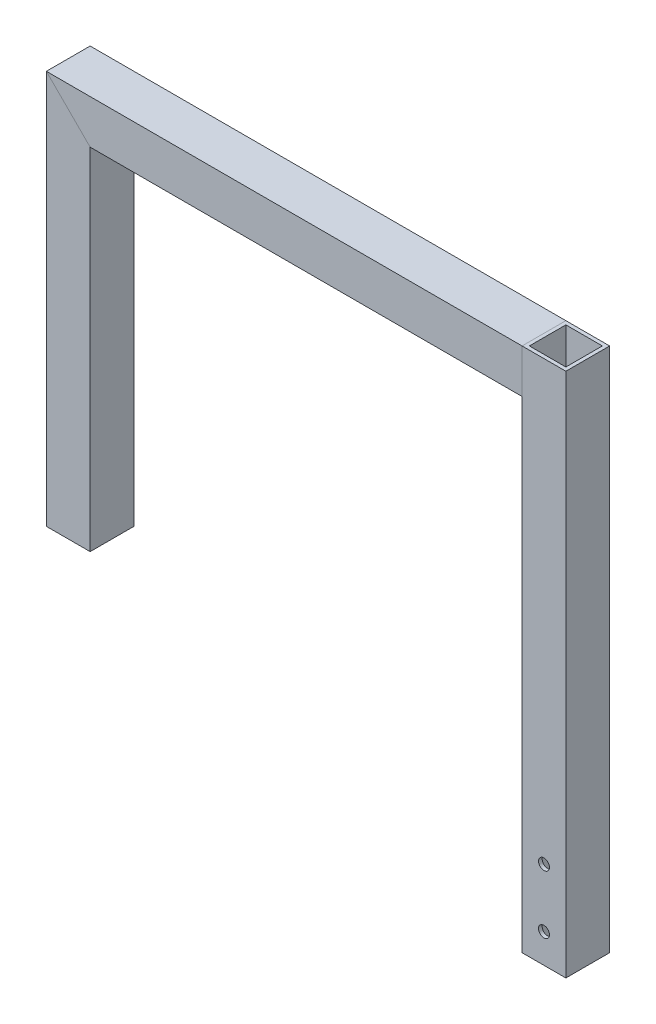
ISO-10303-21;
HEADER;
FILE_DESCRIPTION(('STEP AP214'),'2;1');
FILE_NAME('part.step','',(''),(''),'','','');
FILE_SCHEMA(('AUTOMOTIVE_DESIGN { 1 0 10303 214 1 1 1 1 }'));
ENDSEC;
DATA;
#1=APPLICATION_CONTEXT('core data for automotive mechanical design processes');
#2=APPLICATION_PROTOCOL_DEFINITION('international standard','automotive_design',2000,#1);
#3=PRODUCT_CONTEXT('',#1,'mechanical');
#4=PRODUCT('Part','Part','',(#3));
#5=PRODUCT_RELATED_PRODUCT_CATEGORY('part','',(#4));
#6=PRODUCT_DEFINITION_FORMATION('','',#4);
#7=PRODUCT_DEFINITION_CONTEXT('part definition',#1,'design');
#8=PRODUCT_DEFINITION('design','',#6,#7);
#9=PRODUCT_DEFINITION_SHAPE('','',#8);
#10=(LENGTH_UNIT() NAMED_UNIT(*) SI_UNIT(.MILLI.,.METRE.));
#11=(NAMED_UNIT(*) PLANE_ANGLE_UNIT() SI_UNIT($,.RADIAN.));
#12=(NAMED_UNIT(*) SI_UNIT($,.STERADIAN.) SOLID_ANGLE_UNIT());
#13=UNCERTAINTY_MEASURE_WITH_UNIT(LENGTH_MEASURE(1.E-05),#10,'distance_accuracy_value','');
#14=(GEOMETRIC_REPRESENTATION_CONTEXT(3) GLOBAL_UNCERTAINTY_ASSIGNED_CONTEXT((#13)) GLOBAL_UNIT_ASSIGNED_CONTEXT((#10,
#11,#12)) REPRESENTATION_CONTEXT('',''));
#15=CARTESIAN_POINT('',(0.,0.,0.));
#16=DIRECTION('',(0.,0.,1.));
#17=DIRECTION('',(1.,0.,0.));
#18=AXIS2_PLACEMENT_3D('',#15,#16,#17);
#19=CARTESIAN_POINT('',(-413.893,381.,38.1000000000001));
#20=DIRECTION('',(0.707106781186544,0.707106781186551,0.));
#21=DIRECTION('',(-0.707106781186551,0.707106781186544,0.));
#22=AXIS2_PLACEMENT_3D('',#19,#20,#21);
#23=PLANE('',#22);
#24=DIRECTION('',(0.,0.,1.));
#25=VECTOR('',#24,1.);
#26=CARTESIAN_POINT('',(-375.793,342.9,0.));
#27=LINE('',#26,#25);
#28=CARTESIAN_POINT('',(-375.793,342.9,0.));
#29=VERTEX_POINT('',#28);
#30=CARTESIAN_POINT('',(-375.793,342.9,38.1));
#31=VERTEX_POINT('',#30);
#32=EDGE_CURVE('E13',#29,#31,#27,.T.);
#33=ORIENTED_EDGE('',*,*,#32,.F.);
#34=DIRECTION('',(-0.707106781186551,0.707106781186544,0.));
#35=VECTOR('',#34,1.);
#36=CARTESIAN_POINT('',(-417.838384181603,384.945384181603,0.));
#37=LINE('',#36,#35);
#38=CARTESIAN_POINT('',(-413.893,381.,0.));
#39=VERTEX_POINT('',#38);
#40=EDGE_CURVE('E156',#29,#39,#37,.T.);
#41=ORIENTED_EDGE('',*,*,#40,.T.);
#42=DIRECTION('',(0.,0.,1.));
#43=VECTOR('',#42,1.);
#44=CARTESIAN_POINT('',(-413.893,381.,0.));
#45=LINE('',#44,#43);
#46=CARTESIAN_POINT('',(-413.893,381.,38.1));
#47=VERTEX_POINT('',#46);
#48=EDGE_CURVE('E243',#39,#47,#45,.T.);
#49=ORIENTED_EDGE('',*,*,#48,.T.);
#50=DIRECTION('',(-0.707106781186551,0.707106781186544,0.));
#51=VECTOR('',#50,1.);
#52=CARTESIAN_POINT('',(-417.838384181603,384.945384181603,38.1));
#53=LINE('',#52,#51);
#54=EDGE_CURVE('E198',#31,#47,#53,.T.);
#55=ORIENTED_EDGE('',*,*,#54,.F.);
#56=EDGE_LOOP('',(#33,#41,#49,#55));
#57=FACE_BOUND('',#56,.T.);
#58=DIRECTION('',(-0.707106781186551,0.707106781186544,0.));
#59=VECTOR('',#58,1.);
#60=CARTESIAN_POINT('',(-419.425884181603,386.532884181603,3.17499999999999));
#61=LINE('',#60,#59);
#62=CARTESIAN_POINT('',(-378.968,346.075,3.175));
#63=VERTEX_POINT('',#62);
#64=CARTESIAN_POINT('',(-410.718,377.825,3.175));
#65=VERTEX_POINT('',#64);
#66=EDGE_CURVE('E141',#63,#65,#61,.T.);
#67=ORIENTED_EDGE('',*,*,#66,.F.);
#68=DIRECTION('',(0.,0.,1.));
#69=VECTOR('',#68,1.);
#70=CARTESIAN_POINT('',(-378.968,346.075,3.17500000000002));
#71=LINE('',#70,#69);
#72=CARTESIAN_POINT('',(-378.968,346.075,34.925));
#73=VERTEX_POINT('',#72);
#74=EDGE_CURVE('E241',#63,#73,#71,.T.);
#75=ORIENTED_EDGE('',*,*,#74,.T.);
#76=DIRECTION('',(-0.707106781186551,0.707106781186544,0.));
#77=VECTOR('',#76,1.);
#78=CARTESIAN_POINT('',(-419.425884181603,386.532884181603,34.925));
#79=LINE('',#78,#77);
#80=CARTESIAN_POINT('',(-410.718,377.825,34.925));
#81=VERTEX_POINT('',#80);
#82=EDGE_CURVE('E238',#73,#81,#79,.T.);
#83=ORIENTED_EDGE('',*,*,#82,.T.);
#84=DIRECTION('',(0.,0.,1.));
#85=VECTOR('',#84,1.);
#86=CARTESIAN_POINT('',(-410.718,377.825,3.17500000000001));
#87=LINE('',#86,#85);
#88=EDGE_CURVE('E235',#65,#81,#87,.T.);
#89=ORIENTED_EDGE('',*,*,#88,.F.);
#90=EDGE_LOOP('',(#67,#75,#83,#89));
#91=FACE_BOUND('',#90,.T.);
#92=ADVANCED_FACE('F123',(#57,#91),#23,.T.);
#93=CARTESIAN_POINT('',(-378.968,426.990768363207,3.175));
#94=DIRECTION('',(1.,0.,0.));
#95=DIRECTION('',(0.,0.,-1.));
#96=AXIS2_PLACEMENT_3D('',#93,#94,#95);
#97=PLANE('',#96);
#98=ORIENTED_EDGE('',*,*,#74,.F.);
#99=DIRECTION('',(0.,-1.,0.));
#100=VECTOR('',#99,1.);
#101=CARTESIAN_POINT('',(-378.968,426.990768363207,3.175));
#102=LINE('',#101,#100);
#103=CARTESIAN_POINT('',(-378.968,38.1,3.175));
#104=VERTEX_POINT('',#103);
#105=EDGE_CURVE('E126',#63,#104,#102,.T.);
#106=ORIENTED_EDGE('',*,*,#105,.T.);
#107=DIRECTION('',(0.,0.,1.));
#108=VECTOR('',#107,1.);
#109=CARTESIAN_POINT('',(-378.968,38.1,3.175));
#110=LINE('',#109,#108);
#111=CARTESIAN_POINT('',(-378.968,38.1,34.925));
#112=VERTEX_POINT('',#111);
#113=EDGE_CURVE('E210',#104,#112,#110,.T.);
#114=ORIENTED_EDGE('',*,*,#113,.T.);
#115=DIRECTION('',(0.,-1.,0.));
#116=VECTOR('',#115,1.);
#117=CARTESIAN_POINT('',(-378.968,426.990768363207,34.925));
#118=LINE('',#117,#116);
#119=EDGE_CURVE('E237',#73,#112,#118,.T.);
#120=ORIENTED_EDGE('',*,*,#119,.F.);
#121=EDGE_LOOP('',(#98,#106,#114,#120));
#122=FACE_BOUND('',#121,.T.);
#123=ADVANCED_FACE('F254',(#122),#97,.F.);
#124=CARTESIAN_POINT('',(-378.968,426.990768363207,34.925));
#125=DIRECTION('',(0.,0.,1.));
#126=DIRECTION('',(1.,0.,0.));
#127=AXIS2_PLACEMENT_3D('',#124,#125,#126);
#128=PLANE('',#127);
#129=ORIENTED_EDGE('',*,*,#82,.F.);
#130=ORIENTED_EDGE('',*,*,#119,.T.);
#131=DIRECTION('',(-1.,0.,0.));
#132=VECTOR('',#131,1.);
#133=CARTESIAN_POINT('',(-378.968,38.1,34.925));
#134=LINE('',#133,#132);
#135=CARTESIAN_POINT('',(-410.718,38.1,34.925));
#136=VERTEX_POINT('',#135);
#137=EDGE_CURVE('E205',#112,#136,#134,.T.);
#138=ORIENTED_EDGE('',*,*,#137,.T.);
#139=DIRECTION('',(0.,-1.,0.));
#140=VECTOR('',#139,1.);
#141=CARTESIAN_POINT('',(-410.718,426.990768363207,34.925));
#142=LINE('',#141,#140);
#143=EDGE_CURVE('E164',#81,#136,#142,.T.);
#144=ORIENTED_EDGE('',*,*,#143,.F.);
#145=EDGE_LOOP('',(#129,#130,#138,#144));
#146=FACE_BOUND('',#145,.T.);
#147=ADVANCED_FACE('F256',(#146),#128,.F.);
#148=CARTESIAN_POINT('',(-410.718,426.990768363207,3.175));
#149=DIRECTION('',(1.,0.,0.));
#150=DIRECTION('',(0.,0.,-1.));
#151=AXIS2_PLACEMENT_3D('',#148,#149,#150);
#152=PLANE('',#151);
#153=DIRECTION('',(0.,-1.,0.));
#154=VECTOR('',#153,1.);
#155=CARTESIAN_POINT('',(-410.718,426.990768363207,3.175));
#156=LINE('',#155,#154);
#157=CARTESIAN_POINT('',(-410.718,38.1,3.175));
#158=VERTEX_POINT('',#157);
#159=EDGE_CURVE('E192',#65,#158,#156,.T.);
#160=ORIENTED_EDGE('',*,*,#159,.F.);
#161=ORIENTED_EDGE('',*,*,#88,.T.);
#162=ORIENTED_EDGE('',*,*,#143,.T.);
#163=DIRECTION('',(0.,0.,1.));
#164=VECTOR('',#163,1.);
#165=CARTESIAN_POINT('',(-410.718,38.1,3.175));
#166=LINE('',#165,#164);
#167=EDGE_CURVE('E201',#158,#136,#166,.T.);
#168=ORIENTED_EDGE('',*,*,#167,.F.);
#169=EDGE_LOOP('',(#160,#161,#162,#168));
#170=FACE_BOUND('',#169,.T.);
#171=ADVANCED_FACE('F202',(#170),#152,.T.);
#172=CARTESIAN_POINT('',(-378.968,426.990768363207,3.175));
#173=DIRECTION('',(0.,0.,1.));
#174=DIRECTION('',(1.,0.,0.));
#175=AXIS2_PLACEMENT_3D('',#172,#173,#174);
#176=PLANE('',#175);
#177=ORIENTED_EDGE('',*,*,#105,.F.);
#178=ORIENTED_EDGE('',*,*,#66,.T.);
#179=ORIENTED_EDGE('',*,*,#159,.T.);
#180=DIRECTION('',(-1.,0.,0.));
#181=VECTOR('',#180,1.);
#182=CARTESIAN_POINT('',(-378.968,38.1,3.175));
#183=LINE('',#182,#181);
#184=EDGE_CURVE('E195',#104,#158,#183,.T.);
#185=ORIENTED_EDGE('',*,*,#184,.F.);
#186=EDGE_LOOP('',(#177,#178,#179,#185));
#187=FACE_BOUND('',#186,.T.);
#188=ADVANCED_FACE('F193',(#187),#176,.T.);
#189=CARTESIAN_POINT('',(-375.793,426.990768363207,38.1));
#190=DIRECTION('',(0.,0.,1.));
#191=DIRECTION('',(1.,0.,0.));
#192=AXIS2_PLACEMENT_3D('',#189,#190,#191);
#193=PLANE('',#192);
#194=DIRECTION('',(0.,-1.,0.));
#195=VECTOR('',#194,1.);
#196=CARTESIAN_POINT('',(-413.893,426.990768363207,38.1));
#197=LINE('',#196,#195);
#198=CARTESIAN_POINT('',(-413.893,38.1,38.1));
#199=VERTEX_POINT('',#198);
#200=EDGE_CURVE('E233',#47,#199,#197,.T.);
#201=ORIENTED_EDGE('',*,*,#200,.T.);
#202=DIRECTION('',(-1.,0.,0.));
#203=VECTOR('',#202,1.);
#204=CARTESIAN_POINT('',(-375.793,38.1,38.1));
#205=LINE('',#204,#203);
#206=CARTESIAN_POINT('',(-375.793,38.1,38.1));
#207=VERTEX_POINT('',#206);
#208=EDGE_CURVE('E218',#207,#199,#205,.T.);
#209=ORIENTED_EDGE('',*,*,#208,.F.);
#210=DIRECTION('',(0.,1.,0.));
#211=VECTOR('',#210,1.);
#212=CARTESIAN_POINT('',(-375.793,38.1,38.1));
#213=LINE('',#212,#211);
#214=EDGE_CURVE('E229',#207,#31,#213,.T.);
#215=ORIENTED_EDGE('',*,*,#214,.T.);
#216=ORIENTED_EDGE('',*,*,#54,.T.);
#217=EDGE_LOOP('',(#201,#209,#215,#216));
#218=FACE_BOUND('',#217,.T.);
#219=ADVANCED_FACE('F280',(#218),#193,.T.);
#220=CARTESIAN_POINT('',(-413.893,426.990768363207,0.));
#221=DIRECTION('',(1.,0.,0.));
#222=DIRECTION('',(0.,0.,-1.));
#223=AXIS2_PLACEMENT_3D('',#220,#221,#222);
#224=PLANE('',#223);
#225=ORIENTED_EDGE('',*,*,#48,.F.);
#226=DIRECTION('',(0.,-1.,0.));
#227=VECTOR('',#226,1.);
#228=CARTESIAN_POINT('',(-413.893,426.990768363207,0.));
#229=LINE('',#228,#227);
#230=CARTESIAN_POINT('',(-413.893,38.1,0.));
#231=VERTEX_POINT('',#230);
#232=EDGE_CURVE('E132',#39,#231,#229,.T.);
#233=ORIENTED_EDGE('',*,*,#232,.T.);
#234=DIRECTION('',(0.,0.,1.));
#235=VECTOR('',#234,1.);
#236=CARTESIAN_POINT('',(-413.893,38.1,0.));
#237=LINE('',#236,#235);
#238=EDGE_CURVE('E221',#231,#199,#237,.T.);
#239=ORIENTED_EDGE('',*,*,#238,.T.);
#240=ORIENTED_EDGE('',*,*,#200,.F.);
#241=EDGE_LOOP('',(#225,#233,#239,#240));
#242=FACE_BOUND('',#241,.T.);
#243=ADVANCED_FACE('F278',(#242),#224,.F.);
#244=CARTESIAN_POINT('',(-375.793,426.990768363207,0.));
#245=DIRECTION('',(0.,0.,1.));
#246=DIRECTION('',(1.,0.,0.));
#247=AXIS2_PLACEMENT_3D('',#244,#245,#246);
#248=PLANE('',#247);
#249=ORIENTED_EDGE('',*,*,#40,.F.);
#250=DIRECTION('',(0.,1.,0.));
#251=VECTOR('',#250,1.);
#252=CARTESIAN_POINT('',(-375.793,38.1,0.));
#253=LINE('',#252,#251);
#254=CARTESIAN_POINT('',(-375.793,38.1,0.));
#255=VERTEX_POINT('',#254);
#256=EDGE_CURVE('E227',#255,#29,#253,.T.);
#257=ORIENTED_EDGE('',*,*,#256,.F.);
#258=DIRECTION('',(-1.,0.,0.));
#259=VECTOR('',#258,1.);
#260=CARTESIAN_POINT('',(-375.793,38.1,0.));
#261=LINE('',#260,#259);
#262=EDGE_CURVE('E224',#255,#231,#261,.T.);
#263=ORIENTED_EDGE('',*,*,#262,.T.);
#264=ORIENTED_EDGE('',*,*,#232,.F.);
#265=EDGE_LOOP('',(#249,#257,#263,#264));
#266=FACE_BOUND('',#265,.T.);
#267=ADVANCED_FACE('F271',(#266),#248,.F.);
#268=CARTESIAN_POINT('',(-375.793,38.1,0.));
#269=DIRECTION('',(-1.,0.,0.));
#270=DIRECTION('',(0.,0.,1.));
#271=AXIS2_PLACEMENT_3D('',#268,#269,#270);
#272=PLANE('',#271);
#273=ORIENTED_EDGE('',*,*,#32,.T.);
#274=ORIENTED_EDGE('',*,*,#214,.F.);
#275=DIRECTION('',(0.,0.,1.));
#276=VECTOR('',#275,1.);
#277=CARTESIAN_POINT('',(-375.793,38.1,0.));
#278=LINE('',#277,#276);
#279=EDGE_CURVE('E215',#255,#207,#278,.T.);
#280=ORIENTED_EDGE('',*,*,#279,.F.);
#281=ORIENTED_EDGE('',*,*,#256,.T.);
#282=EDGE_LOOP('',(#273,#274,#280,#281));
#283=FACE_BOUND('',#282,.T.);
#284=ADVANCED_FACE('F281',(#283),#272,.F.);
#285=CARTESIAN_POINT('',(0.,38.1,0.));
#286=DIRECTION('',(0.,-1.,0.));
#287=DIRECTION('',(0.,0.,-1.));
#288=AXIS2_PLACEMENT_3D('',#285,#286,#287);
#289=PLANE('',#288);
#290=ORIENTED_EDGE('',*,*,#184,.T.);
#291=ORIENTED_EDGE('',*,*,#167,.T.);
#292=ORIENTED_EDGE('',*,*,#137,.F.);
#293=ORIENTED_EDGE('',*,*,#113,.F.);
#294=EDGE_LOOP('',(#290,#291,#292,#293));
#295=FACE_BOUND('',#294,.T.);
#296=ORIENTED_EDGE('',*,*,#279,.T.);
#297=ORIENTED_EDGE('',*,*,#208,.T.);
#298=ORIENTED_EDGE('',*,*,#238,.F.);
#299=ORIENTED_EDGE('',*,*,#262,.F.);
#300=EDGE_LOOP('',(#296,#297,#298,#299));
#301=FACE_BOUND('',#300,.T.);
#302=ADVANCED_FACE('F207',(#295,#301),#289,.T.);
#303=CLOSED_SHELL('',(#92,#123,#147,#171,#188,#219,#243,#267,#284,#302));
#304=MANIFOLD_SOLID_BREP('B2',#303);
#305=CARTESIAN_POINT('',(-413.893,381.,0.));
#306=DIRECTION('',(0.,0.,1.));
#307=DIRECTION('',(0.,-1.,0.));
#308=AXIS2_PLACEMENT_3D('',#305,#306,#307);
#309=PLANE('',#308);
#310=DIRECTION('',(1.,0.,0.));
#311=VECTOR('',#310,1.);
#312=CARTESIAN_POINT('',(-413.893,342.9,0.));
#313=LINE('',#312,#311);
#314=CARTESIAN_POINT('',(-375.793,342.9,0.));
#315=VERTEX_POINT('',#314);
#316=CARTESIAN_POINT('',(0.,342.9,0.));
#317=VERTEX_POINT('',#316);
#318=EDGE_CURVE('E368',#315,#317,#313,.T.);
#319=ORIENTED_EDGE('',*,*,#318,.F.);
#320=DIRECTION('',(0.707106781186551,-0.707106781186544,0.));
#321=VECTOR('',#320,1.);
#322=CARTESIAN_POINT('',(-413.893,381.,0.));
#323=LINE('',#322,#321);
#324=CARTESIAN_POINT('',(-413.893,381.,0.));
#325=VERTEX_POINT('',#324);
#326=EDGE_CURVE('E430',#325,#315,#323,.T.);
#327=ORIENTED_EDGE('',*,*,#326,.F.);
#328=DIRECTION('',(1.,0.,0.));
#329=VECTOR('',#328,1.);
#330=CARTESIAN_POINT('',(-413.893,381.,0.));
#331=LINE('',#330,#329);
#332=CARTESIAN_POINT('',(0.,381.,0.));
#333=VERTEX_POINT('',#332);
#334=EDGE_CURVE('E449',#325,#333,#331,.T.);
#335=ORIENTED_EDGE('',*,*,#334,.T.);
#336=DIRECTION('',(0.,-1.,0.));
#337=VECTOR('',#336,1.);
#338=CARTESIAN_POINT('',(0.,381.,0.));
#339=LINE('',#338,#337);
#340=EDGE_CURVE('E460',#333,#317,#339,.T.);
#341=ORIENTED_EDGE('',*,*,#340,.T.);
#342=EDGE_LOOP('',(#319,#327,#335,#341));
#343=FACE_BOUND('',#342,.T.);
#344=ADVANCED_FACE('F361',(#343),#309,.F.);
#345=CARTESIAN_POINT('',(-413.893,342.9,0.));
#346=DIRECTION('',(0.,1.,0.));
#347=DIRECTION('',(0.,0.,1.));
#348=AXIS2_PLACEMENT_3D('',#345,#346,#347);
#349=PLANE('',#348);
#350=DIRECTION('',(1.,0.,0.));
#351=VECTOR('',#350,1.);
#352=CARTESIAN_POINT('',(-413.893,342.9,38.1000000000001));
#353=LINE('',#352,#351);
#354=CARTESIAN_POINT('',(-375.793,342.9,38.1000000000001));
#355=VERTEX_POINT('',#354);
#356=CARTESIAN_POINT('',(0.,342.9,38.1));
#357=VERTEX_POINT('',#356);
#358=EDGE_CURVE('E439',#355,#357,#353,.T.);
#359=ORIENTED_EDGE('',*,*,#358,.F.);
#360=DIRECTION('',(0.,0.,-1.));
#361=VECTOR('',#360,1.);
#362=CARTESIAN_POINT('',(-375.793,342.9,38.1000000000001));
#363=LINE('',#362,#361);
#364=EDGE_CURVE('E424',#355,#315,#363,.T.);
#365=ORIENTED_EDGE('',*,*,#364,.T.);
#366=ORIENTED_EDGE('',*,*,#318,.T.);
#367=DIRECTION('',(0.,0.,1.));
#368=VECTOR('',#367,1.);
#369=CARTESIAN_POINT('',(0.,342.9,0.));
#370=LINE('',#369,#368);
#371=EDGE_CURVE('E446',#317,#357,#370,.T.);
#372=ORIENTED_EDGE('',*,*,#371,.T.);
#373=EDGE_LOOP('',(#359,#365,#366,#372));
#374=FACE_BOUND('',#373,.T.);
#375=ADVANCED_FACE('F444',(#374),#349,.F.);
#376=CARTESIAN_POINT('',(-413.893,381.,38.1000000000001));
#377=DIRECTION('',(0.,0.,1.));
#378=DIRECTION('',(0.,-1.,0.));
#379=AXIS2_PLACEMENT_3D('',#376,#377,#378);
#380=PLANE('',#379);
#381=DIRECTION('',(0.707106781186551,-0.707106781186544,0.));
#382=VECTOR('',#381,1.);
#383=CARTESIAN_POINT('',(-413.893,381.,38.1000000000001));
#384=LINE('',#383,#382);
#385=CARTESIAN_POINT('',(-413.893,381.,38.1000000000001));
#386=VERTEX_POINT('',#385);
#387=EDGE_CURVE('E427',#386,#355,#384,.T.);
#388=ORIENTED_EDGE('',*,*,#387,.T.);
#389=ORIENTED_EDGE('',*,*,#358,.T.);
#390=DIRECTION('',(0.,-1.,0.));
#391=VECTOR('',#390,1.);
#392=CARTESIAN_POINT('',(0.,381.,38.1));
#393=LINE('',#392,#391);
#394=CARTESIAN_POINT('',(0.,381.,38.1));
#395=VERTEX_POINT('',#394);
#396=EDGE_CURVE('E457',#395,#357,#393,.T.);
#397=ORIENTED_EDGE('',*,*,#396,.F.);
#398=DIRECTION('',(1.,0.,0.));
#399=VECTOR('',#398,1.);
#400=CARTESIAN_POINT('',(-413.893,381.,38.1000000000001));
#401=LINE('',#400,#399);
#402=EDGE_CURVE('E441',#386,#395,#401,.T.);
#403=ORIENTED_EDGE('',*,*,#402,.F.);
#404=EDGE_LOOP('',(#388,#389,#397,#403));
#405=FACE_BOUND('',#404,.T.);
#406=ADVANCED_FACE('F437',(#405),#380,.T.);
#407=CARTESIAN_POINT('',(-413.893,381.,0.));
#408=DIRECTION('',(0.,1.,0.));
#409=DIRECTION('',(0.,0.,1.));
#410=AXIS2_PLACEMENT_3D('',#407,#408,#409);
#411=PLANE('',#410);
#412=DIRECTION('',(0.,0.,1.));
#413=VECTOR('',#412,1.);
#414=CARTESIAN_POINT('',(0.,381.,0.));
#415=LINE('',#414,#413);
#416=EDGE_CURVE('E454',#333,#395,#415,.T.);
#417=ORIENTED_EDGE('',*,*,#416,.F.);
#418=ORIENTED_EDGE('',*,*,#334,.F.);
#419=DIRECTION('',(0.,0.,1.));
#420=VECTOR('',#419,1.);
#421=CARTESIAN_POINT('',(-413.893,381.,0.));
#422=LINE('',#421,#420);
#423=EDGE_CURVE('E453',#325,#386,#422,.T.);
#424=ORIENTED_EDGE('',*,*,#423,.T.);
#425=ORIENTED_EDGE('',*,*,#402,.T.);
#426=EDGE_LOOP('',(#417,#418,#424,#425));
#427=FACE_BOUND('',#426,.T.);
#428=ADVANCED_FACE('F510',(#427),#411,.T.);
#429=CARTESIAN_POINT('',(0.,0.,0.));
#430=DIRECTION('',(-1.,0.,0.));
#431=DIRECTION('',(0.,0.,1.));
#432=AXIS2_PLACEMENT_3D('',#429,#430,#431);
#433=PLANE('',#432);
#434=DIRECTION('',(0.,-1.,0.));
#435=VECTOR('',#434,1.);
#436=CARTESIAN_POINT('',(0.,377.825,34.925));
#437=LINE('',#436,#435);
#438=CARTESIAN_POINT('',(0.,377.825,34.925));
#439=VERTEX_POINT('',#438);
#440=CARTESIAN_POINT('',(0.,346.075,34.925));
#441=VERTEX_POINT('',#440);
#442=EDGE_CURVE('E477',#439,#441,#437,.T.);
#443=ORIENTED_EDGE('',*,*,#442,.F.);
#444=DIRECTION('',(0.,0.,1.));
#445=VECTOR('',#444,1.);
#446=CARTESIAN_POINT('',(0.,377.825,3.17500000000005));
#447=LINE('',#446,#445);
#448=CARTESIAN_POINT('',(0.,377.825,3.17500000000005));
#449=VERTEX_POINT('',#448);
#450=EDGE_CURVE('E479',#449,#439,#447,.T.);
#451=ORIENTED_EDGE('',*,*,#450,.F.);
#452=DIRECTION('',(0.,-1.,0.));
#453=VECTOR('',#452,1.);
#454=CARTESIAN_POINT('',(0.,377.825,3.17500000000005));
#455=LINE('',#454,#453);
#456=CARTESIAN_POINT('',(0.,346.075,3.175));
#457=VERTEX_POINT('',#456);
#458=EDGE_CURVE('E467',#449,#457,#455,.T.);
#459=ORIENTED_EDGE('',*,*,#458,.T.);
#460=DIRECTION('',(0.,0.,1.));
#461=VECTOR('',#460,1.);
#462=CARTESIAN_POINT('',(0.,346.075,3.175));
#463=LINE('',#462,#461);
#464=EDGE_CURVE('E474',#457,#441,#463,.T.);
#465=ORIENTED_EDGE('',*,*,#464,.T.);
#466=EDGE_LOOP('',(#443,#451,#459,#465));
#467=FACE_BOUND('',#466,.T.);
#468=ORIENTED_EDGE('',*,*,#340,.F.);
#469=ORIENTED_EDGE('',*,*,#416,.T.);
#470=ORIENTED_EDGE('',*,*,#396,.T.);
#471=ORIENTED_EDGE('',*,*,#371,.F.);
#472=EDGE_LOOP('',(#468,#469,#470,#471));
#473=FACE_BOUND('',#472,.T.);
#474=ADVANCED_FACE('F499',(#467,#473),#433,.F.);
#475=CARTESIAN_POINT('',(-413.893,377.825,3.1750000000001));
#476=DIRECTION('',(0.,1.,0.));
#477=DIRECTION('',(0.,0.,1.));
#478=AXIS2_PLACEMENT_3D('',#475,#476,#477);
#479=PLANE('',#478);
#480=DIRECTION('',(1.,0.,0.));
#481=VECTOR('',#480,1.);
#482=CARTESIAN_POINT('',(-413.893,377.825,34.9250000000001));
#483=LINE('',#482,#481);
#484=CARTESIAN_POINT('',(-410.718,377.825,34.9250000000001));
#485=VERTEX_POINT('',#484);
#486=EDGE_CURVE('E381',#485,#439,#483,.T.);
#487=ORIENTED_EDGE('',*,*,#486,.F.);
#488=DIRECTION('',(0.,0.,-1.));
#489=VECTOR('',#488,1.);
#490=CARTESIAN_POINT('',(-410.718,377.825,3.1750000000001));
#491=LINE('',#490,#489);
#492=CARTESIAN_POINT('',(-410.718,377.825,3.1750000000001));
#493=VERTEX_POINT('',#492);
#494=EDGE_CURVE('E375',#485,#493,#491,.T.);
#495=ORIENTED_EDGE('',*,*,#494,.T.);
#496=DIRECTION('',(1.,0.,0.));
#497=VECTOR('',#496,1.);
#498=CARTESIAN_POINT('',(-413.893,377.825,3.1750000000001));
#499=LINE('',#498,#497);
#500=EDGE_CURVE('E463',#493,#449,#499,.T.);
#501=ORIENTED_EDGE('',*,*,#500,.T.);
#502=ORIENTED_EDGE('',*,*,#450,.T.);
#503=EDGE_LOOP('',(#487,#495,#501,#502));
#504=FACE_BOUND('',#503,.T.);
#505=ADVANCED_FACE('F502',(#504),#479,.F.);
#506=CARTESIAN_POINT('',(-413.893,377.825,3.1750000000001));
#507=DIRECTION('',(0.,0.,1.));
#508=DIRECTION('',(0.,-1.,0.));
#509=AXIS2_PLACEMENT_3D('',#506,#507,#508);
#510=PLANE('',#509);
#511=DIRECTION('',(-0.707106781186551,0.707106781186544,0.));
#512=VECTOR('',#511,1.);
#513=CARTESIAN_POINT('',(-412.3055,379.4125,3.1750000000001));
#514=LINE('',#513,#512);
#515=CARTESIAN_POINT('',(-378.968,346.075,3.175));
#516=VERTEX_POINT('',#515);
#517=EDGE_CURVE('E482',#516,#493,#514,.T.);
#518=ORIENTED_EDGE('',*,*,#517,.F.);
#519=DIRECTION('',(1.,0.,0.));
#520=VECTOR('',#519,1.);
#521=CARTESIAN_POINT('',(-413.893,346.075,3.17500000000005));
#522=LINE('',#521,#520);
#523=EDGE_CURVE('E469',#516,#457,#522,.T.);
#524=ORIENTED_EDGE('',*,*,#523,.T.);
#525=ORIENTED_EDGE('',*,*,#458,.F.);
#526=ORIENTED_EDGE('',*,*,#500,.F.);
#527=EDGE_LOOP('',(#518,#524,#525,#526));
#528=FACE_BOUND('',#527,.T.);
#529=ADVANCED_FACE('F492',(#528),#510,.T.);
#530=CARTESIAN_POINT('',(-413.893,346.075,3.17500000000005));
#531=DIRECTION('',(0.,1.,0.));
#532=DIRECTION('',(0.,0.,1.));
#533=AXIS2_PLACEMENT_3D('',#530,#531,#532);
#534=PLANE('',#533);
#535=DIRECTION('',(0.,0.,-1.));
#536=VECTOR('',#535,1.);
#537=CARTESIAN_POINT('',(-378.968,346.075,3.17500000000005));
#538=LINE('',#537,#536);
#539=CARTESIAN_POINT('',(-378.968,346.075,34.9250000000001));
#540=VERTEX_POINT('',#539);
#541=EDGE_CURVE('E434',#540,#516,#538,.T.);
#542=ORIENTED_EDGE('',*,*,#541,.F.);
#543=DIRECTION('',(1.,0.,0.));
#544=VECTOR('',#543,1.);
#545=CARTESIAN_POINT('',(-413.893,346.075,34.9250000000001));
#546=LINE('',#545,#544);
#547=EDGE_CURVE('E466',#540,#441,#546,.T.);
#548=ORIENTED_EDGE('',*,*,#547,.T.);
#549=ORIENTED_EDGE('',*,*,#464,.F.);
#550=ORIENTED_EDGE('',*,*,#523,.F.);
#551=EDGE_LOOP('',(#542,#548,#549,#550));
#552=FACE_BOUND('',#551,.T.);
#553=ADVANCED_FACE('F495',(#552),#534,.T.);
#554=CARTESIAN_POINT('',(-413.893,377.825,34.9250000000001));
#555=DIRECTION('',(0.,0.,1.));
#556=DIRECTION('',(1.,0.,0.));
#557=AXIS2_PLACEMENT_3D('',#554,#555,#556);
#558=PLANE('',#557);
#559=ORIENTED_EDGE('',*,*,#547,.F.);
#560=DIRECTION('',(-0.707106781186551,0.707106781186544,0.));
#561=VECTOR('',#560,1.);
#562=CARTESIAN_POINT('',(-412.3055,379.4125,34.9250000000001));
#563=LINE('',#562,#561);
#564=EDGE_CURVE('E121',#540,#485,#563,.T.);
#565=ORIENTED_EDGE('',*,*,#564,.T.);
#566=ORIENTED_EDGE('',*,*,#486,.T.);
#567=ORIENTED_EDGE('',*,*,#442,.T.);
#568=EDGE_LOOP('',(#559,#565,#566,#567));
#569=FACE_BOUND('',#568,.T.);
#570=ADVANCED_FACE('F566',(#569),#558,.F.);
#571=CARTESIAN_POINT('',(-413.893,381.,38.1000000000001));
#572=DIRECTION('',(0.707106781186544,0.707106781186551,0.));
#573=DIRECTION('',(-0.707106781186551,0.707106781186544,0.));
#574=AXIS2_PLACEMENT_3D('',#571,#572,#573);
#575=PLANE('',#574);
#576=ORIENTED_EDGE('',*,*,#326,.T.);
#577=ORIENTED_EDGE('',*,*,#364,.F.);
#578=ORIENTED_EDGE('',*,*,#387,.F.);
#579=ORIENTED_EDGE('',*,*,#423,.F.);
#580=EDGE_LOOP('',(#576,#577,#578,#579));
#581=FACE_BOUND('',#580,.T.);
#582=ORIENTED_EDGE('',*,*,#564,.F.);
#583=ORIENTED_EDGE('',*,*,#541,.T.);
#584=ORIENTED_EDGE('',*,*,#517,.T.);
#585=ORIENTED_EDGE('',*,*,#494,.F.);
#586=EDGE_LOOP('',(#582,#583,#584,#585));
#587=FACE_BOUND('',#586,.T.);
#588=ADVANCED_FACE('F426',(#581,#587),#575,.F.);
#589=CLOSED_SHELL('',(#344,#375,#406,#428,#474,#505,#529,#553,#570,#588));
#590=MANIFOLD_SOLID_BREP('B7',#589);
#591=CARTESIAN_POINT('',(0.,-76.2,0.));
#592=DIRECTION('',(0.,0.,1.));
#593=DIRECTION('',(1.,0.,0.));
#594=AXIS2_PLACEMENT_3D('',#591,#592,#593);
#595=PLANE('',#594);
#596=CARTESIAN_POINT('',(19.05,-50.8,0.));
#597=DIRECTION('',(0.,0.,-1.));
#598=DIRECTION('',(-1.,0.,0.));
#599=AXIS2_PLACEMENT_3D('',#596,#597,#598);
#600=CIRCLE('',#599,4.7625);
#601=CARTESIAN_POINT('',(14.2875,-50.8,0.));
#602=VERTEX_POINT('',#601);
#603=EDGE_CURVE('E701',#602,#602,#600,.T.);
#604=ORIENTED_EDGE('',*,*,#603,.F.);
#605=EDGE_LOOP('',(#604));
#606=FACE_BOUND('',#605,.T.);
#607=CARTESIAN_POINT('',(19.05,0.,0.));
#608=DIRECTION('',(0.,0.,-1.));
#609=DIRECTION('',(-1.,0.,0.));
#610=AXIS2_PLACEMENT_3D('',#607,#608,#609);
#611=CIRCLE('',#610,4.7625);
#612=CARTESIAN_POINT('',(14.2875,0.,0.));
#613=VERTEX_POINT('',#612);
#614=EDGE_CURVE('E704',#613,#613,#611,.T.);
#615=ORIENTED_EDGE('',*,*,#614,.F.);
#616=EDGE_LOOP('',(#615));
#617=FACE_BOUND('',#616,.T.);
#618=DIRECTION('',(-1.,0.,0.));
#619=VECTOR('',#618,1.);
#620=CARTESIAN_POINT('',(0.,342.9,0.));
#621=LINE('',#620,#619);
#622=CARTESIAN_POINT('',(38.1,342.9,0.));
#623=VERTEX_POINT('',#622);
#624=CARTESIAN_POINT('',(0.,342.9,0.));
#625=VERTEX_POINT('',#624);
#626=EDGE_CURVE('E359',#623,#625,#621,.T.);
#627=ORIENTED_EDGE('',*,*,#626,.F.);
#628=DIRECTION('',(0.,1.,0.));
#629=VECTOR('',#628,1.);
#630=CARTESIAN_POINT('',(38.1,-76.2,0.));
#631=LINE('',#630,#629);
#632=CARTESIAN_POINT('',(38.1,-76.2,0.));
#633=VERTEX_POINT('',#632);
#634=EDGE_CURVE('E754',#633,#623,#631,.T.);
#635=ORIENTED_EDGE('',*,*,#634,.F.);
#636=DIRECTION('',(1.,0.,0.));
#637=VECTOR('',#636,1.);
#638=CARTESIAN_POINT('',(0.,-76.2,0.));
#639=LINE('',#638,#637);
#640=CARTESIAN_POINT('',(0.,-76.2,0.));
#641=VERTEX_POINT('',#640);
#642=EDGE_CURVE('E749',#641,#633,#639,.T.);
#643=ORIENTED_EDGE('',*,*,#642,.F.);
#644=DIRECTION('',(0.,1.,0.));
#645=VECTOR('',#644,1.);
#646=CARTESIAN_POINT('',(0.,-76.2,0.));
#647=LINE('',#646,#645);
#648=EDGE_CURVE('E671',#641,#625,#647,.T.);
#649=ORIENTED_EDGE('',*,*,#648,.T.);
#650=EDGE_LOOP('',(#627,#635,#643,#649));
#651=FACE_BOUND('',#650,.T.);
#652=ADVANCED_FACE('F591',(#606,#617,#651),#595,.F.);
#653=CARTESIAN_POINT('',(0.,-76.2,0.));
#654=DIRECTION('',(0.,1.,0.));
#655=DIRECTION('',(0.,0.,1.));
#656=AXIS2_PLACEMENT_3D('',#653,#654,#655);
#657=PLANE('',#656);
#658=DIRECTION('',(0.,0.,1.));
#659=VECTOR('',#658,1.);
#660=CARTESIAN_POINT('',(0.,-76.2,0.));
#661=LINE('',#660,#659);
#662=CARTESIAN_POINT('',(0.,-76.2,38.1));
#663=VERTEX_POINT('',#662);
#664=EDGE_CURVE('E741',#641,#663,#661,.T.);
#665=ORIENTED_EDGE('',*,*,#664,.F.);
#666=ORIENTED_EDGE('',*,*,#642,.T.);
#667=DIRECTION('',(0.,0.,1.));
#668=VECTOR('',#667,1.);
#669=CARTESIAN_POINT('',(38.1,-76.2,0.));
#670=LINE('',#669,#668);
#671=CARTESIAN_POINT('',(38.1,-76.2,38.1));
#672=VERTEX_POINT('',#671);
#673=EDGE_CURVE('E747',#633,#672,#670,.T.);
#674=ORIENTED_EDGE('',*,*,#673,.T.);
#675=DIRECTION('',(1.,0.,0.));
#676=VECTOR('',#675,1.);
#677=CARTESIAN_POINT('',(0.,-76.2,38.1));
#678=LINE('',#677,#676);
#679=EDGE_CURVE('E744',#663,#672,#678,.T.);
#680=ORIENTED_EDGE('',*,*,#679,.F.);
#681=EDGE_LOOP('',(#665,#666,#674,#680));
#682=FACE_BOUND('',#681,.T.);
#683=DIRECTION('',(0.,0.,-1.));
#684=VECTOR('',#683,1.);
#685=CARTESIAN_POINT('',(3.175,-76.2,0.));
#686=LINE('',#685,#684);
#687=CARTESIAN_POINT('',(3.175,-76.2,34.925));
#688=VERTEX_POINT('',#687);
#689=CARTESIAN_POINT('',(3.175,-76.2,3.175));
#690=VERTEX_POINT('',#689);
#691=EDGE_CURVE('E727',#688,#690,#686,.T.);
#692=ORIENTED_EDGE('',*,*,#691,.F.);
#693=DIRECTION('',(-1.,0.,0.));
#694=VECTOR('',#693,1.);
#695=CARTESIAN_POINT('',(0.,-76.2,34.925));
#696=LINE('',#695,#694);
#697=CARTESIAN_POINT('',(34.925,-76.2,34.925));
#698=VERTEX_POINT('',#697);
#699=EDGE_CURVE('E722',#698,#688,#696,.T.);
#700=ORIENTED_EDGE('',*,*,#699,.F.);
#701=DIRECTION('',(0.,0.,1.));
#702=VECTOR('',#701,1.);
#703=CARTESIAN_POINT('',(34.925,-76.2,0.));
#704=LINE('',#703,#702);
#705=CARTESIAN_POINT('',(34.925,-76.2,3.175));
#706=VERTEX_POINT('',#705);
#707=EDGE_CURVE('E678',#706,#698,#704,.T.);
#708=ORIENTED_EDGE('',*,*,#707,.F.);
#709=DIRECTION('',(1.,0.,0.));
#710=VECTOR('',#709,1.);
#711=CARTESIAN_POINT('',(0.,-76.2,3.175));
#712=LINE('',#711,#710);
#713=EDGE_CURVE('E725',#690,#706,#712,.T.);
#714=ORIENTED_EDGE('',*,*,#713,.F.);
#715=EDGE_LOOP('',(#692,#700,#708,#714));
#716=FACE_BOUND('',#715,.T.);
#717=ADVANCED_FACE('F774',(#682,#716),#657,.F.);
#718=CARTESIAN_POINT('',(0.,381.,0.));
#719=DIRECTION('',(0.,1.,0.));
#720=DIRECTION('',(0.,0.,1.));
#721=AXIS2_PLACEMENT_3D('',#718,#719,#720);
#722=PLANE('',#721);
#723=DIRECTION('',(0.,0.,1.));
#724=VECTOR('',#723,1.);
#725=CARTESIAN_POINT('',(0.,381.,0.));
#726=LINE('',#725,#724);
#727=CARTESIAN_POINT('',(0.,381.,0.));
#728=VERTEX_POINT('',#727);
#729=CARTESIAN_POINT('',(0.,381.,38.1));
#730=VERTEX_POINT('',#729);
#731=EDGE_CURVE('E729',#728,#730,#726,.T.);
#732=ORIENTED_EDGE('',*,*,#731,.T.);
#733=DIRECTION('',(1.,0.,0.));
#734=VECTOR('',#733,1.);
#735=CARTESIAN_POINT('',(0.,381.,38.1));
#736=LINE('',#735,#734);
#737=CARTESIAN_POINT('',(38.1,381.,38.1));
#738=VERTEX_POINT('',#737);
#739=EDGE_CURVE('E732',#730,#738,#736,.T.);
#740=ORIENTED_EDGE('',*,*,#739,.T.);
#741=DIRECTION('',(0.,0.,1.));
#742=VECTOR('',#741,1.);
#743=CARTESIAN_POINT('',(38.1,381.,0.));
#744=LINE('',#743,#742);
#745=CARTESIAN_POINT('',(38.1,381.,0.));
#746=VERTEX_POINT('',#745);
#747=EDGE_CURVE('E735',#746,#738,#744,.T.);
#748=ORIENTED_EDGE('',*,*,#747,.F.);
#749=DIRECTION('',(1.,0.,0.));
#750=VECTOR('',#749,1.);
#751=CARTESIAN_POINT('',(0.,381.,0.));
#752=LINE('',#751,#750);
#753=EDGE_CURVE('E738',#728,#746,#752,.T.);
#754=ORIENTED_EDGE('',*,*,#753,.F.);
#755=EDGE_LOOP('',(#732,#740,#748,#754));
#756=FACE_BOUND('',#755,.T.);
#757=DIRECTION('',(-1.,0.,0.));
#758=VECTOR('',#757,1.);
#759=CARTESIAN_POINT('',(0.,381.,34.925));
#760=LINE('',#759,#758);
#761=CARTESIAN_POINT('',(34.925,381.,34.925));
#762=VERTEX_POINT('',#761);
#763=CARTESIAN_POINT('',(3.175,381.,34.925));
#764=VERTEX_POINT('',#763);
#765=EDGE_CURVE('E659',#762,#764,#760,.T.);
#766=ORIENTED_EDGE('',*,*,#765,.T.);
#767=DIRECTION('',(0.,0.,-1.));
#768=VECTOR('',#767,1.);
#769=CARTESIAN_POINT('',(3.175,381.,0.));
#770=LINE('',#769,#768);
#771=CARTESIAN_POINT('',(3.175,381.,3.175));
#772=VERTEX_POINT('',#771);
#773=EDGE_CURVE('E600',#764,#772,#770,.T.);
#774=ORIENTED_EDGE('',*,*,#773,.T.);
#775=DIRECTION('',(1.,0.,0.));
#776=VECTOR('',#775,1.);
#777=CARTESIAN_POINT('',(0.,381.,3.175));
#778=LINE('',#777,#776);
#779=CARTESIAN_POINT('',(34.925,381.,3.175));
#780=VERTEX_POINT('',#779);
#781=EDGE_CURVE('E684',#772,#780,#778,.T.);
#782=ORIENTED_EDGE('',*,*,#781,.T.);
#783=DIRECTION('',(0.,0.,1.));
#784=VECTOR('',#783,1.);
#785=CARTESIAN_POINT('',(34.925,381.,0.));
#786=LINE('',#785,#784);
#787=EDGE_CURVE('E670',#780,#762,#786,.T.);
#788=ORIENTED_EDGE('',*,*,#787,.T.);
#789=EDGE_LOOP('',(#766,#774,#782,#788));
#790=FACE_BOUND('',#789,.T.);
#791=ADVANCED_FACE('F683',(#756,#790),#722,.T.);
#792=CARTESIAN_POINT('',(0.,-76.2,0.));
#793=DIRECTION('',(-1.,0.,0.));
#794=DIRECTION('',(0.,0.,1.));
#795=AXIS2_PLACEMENT_3D('',#792,#793,#794);
#796=PLANE('',#795);
#797=DIRECTION('',(0.,1.,0.));
#798=VECTOR('',#797,1.);
#799=CARTESIAN_POINT('',(0.,-76.2,38.1));
#800=LINE('',#799,#798);
#801=EDGE_CURVE('E751',#663,#730,#800,.T.);
#802=ORIENTED_EDGE('',*,*,#801,.T.);
#803=ORIENTED_EDGE('',*,*,#731,.F.);
#804=EDGE_CURVE('E753',#625,#728,#647,.T.);
#805=ORIENTED_EDGE('',*,*,#804,.F.);
#806=ORIENTED_EDGE('',*,*,#648,.F.);
#807=ORIENTED_EDGE('',*,*,#664,.T.);
#808=EDGE_LOOP('',(#802,#803,#805,#806,#807));
#809=FACE_BOUND('',#808,.T.);
#810=ADVANCED_FACE('F593',(#809),#796,.T.);
#811=EDGE_CURVE('E757',#623,#746,#631,.T.);
#812=ORIENTED_EDGE('',*,*,#811,.F.);
#813=ORIENTED_EDGE('',*,*,#626,.T.);
#814=ORIENTED_EDGE('',*,*,#804,.T.);
#815=ORIENTED_EDGE('',*,*,#753,.T.);
#816=EDGE_LOOP('',(#812,#813,#814,#815));
#817=FACE_BOUND('',#816,.T.);
#818=ADVANCED_FACE('F770',(#817),#595,.F.);
#819=CARTESIAN_POINT('',(38.1,-76.2,0.));
#820=DIRECTION('',(-1.,0.,0.));
#821=DIRECTION('',(0.,0.,1.));
#822=AXIS2_PLACEMENT_3D('',#819,#820,#821);
#823=PLANE('',#822);
#824=ORIENTED_EDGE('',*,*,#634,.T.);
#825=ORIENTED_EDGE('',*,*,#811,.T.);
#826=ORIENTED_EDGE('',*,*,#747,.T.);
#827=DIRECTION('',(0.,1.,0.));
#828=VECTOR('',#827,1.);
#829=CARTESIAN_POINT('',(38.1,-76.2,38.1));
#830=LINE('',#829,#828);
#831=EDGE_CURVE('E758',#672,#738,#830,.T.);
#832=ORIENTED_EDGE('',*,*,#831,.F.);
#833=ORIENTED_EDGE('',*,*,#673,.F.);
#834=EDGE_LOOP('',(#824,#825,#826,#832,#833));
#835=FACE_BOUND('',#834,.T.);
#836=ADVANCED_FACE('F777',(#835),#823,.F.);
#837=CARTESIAN_POINT('',(0.,-76.2,38.1));
#838=DIRECTION('',(0.,0.,1.));
#839=DIRECTION('',(1.,0.,0.));
#840=AXIS2_PLACEMENT_3D('',#837,#838,#839);
#841=PLANE('',#840);
#842=CARTESIAN_POINT('',(19.05,0.,38.1000000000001));
#843=DIRECTION('',(0.,0.,-1.));
#844=DIRECTION('',(-1.,0.,0.));
#845=AXIS2_PLACEMENT_3D('',#842,#843,#844);
#846=CIRCLE('',#845,4.7625);
#847=CARTESIAN_POINT('',(14.2875,0.,38.1000000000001));
#848=VERTEX_POINT('',#847);
#849=EDGE_CURVE('E697',#848,#848,#846,.T.);
#850=ORIENTED_EDGE('',*,*,#849,.T.);
#851=EDGE_LOOP('',(#850));
#852=FACE_BOUND('',#851,.T.);
#853=CARTESIAN_POINT('',(19.05,-50.8,38.1000000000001));
#854=DIRECTION('',(0.,0.,-1.));
#855=DIRECTION('',(-1.,0.,0.));
#856=AXIS2_PLACEMENT_3D('',#853,#854,#855);
#857=CIRCLE('',#856,4.7625);
#858=CARTESIAN_POINT('',(14.2875,-50.8,38.1000000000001));
#859=VERTEX_POINT('',#858);
#860=EDGE_CURVE('E693',#859,#859,#857,.T.);
#861=ORIENTED_EDGE('',*,*,#860,.T.);
#862=EDGE_LOOP('',(#861));
#863=FACE_BOUND('',#862,.T.);
#864=ORIENTED_EDGE('',*,*,#831,.T.);
#865=ORIENTED_EDGE('',*,*,#739,.F.);
#866=ORIENTED_EDGE('',*,*,#801,.F.);
#867=ORIENTED_EDGE('',*,*,#679,.T.);
#868=EDGE_LOOP('',(#864,#865,#866,#867));
#869=FACE_BOUND('',#868,.T.);
#870=ADVANCED_FACE('F766',(#852,#863,#869),#841,.T.);
#871=CARTESIAN_POINT('',(3.175,-228.6,34.925));
#872=DIRECTION('',(1.,0.,0.));
#873=DIRECTION('',(0.,0.,-1.));
#874=AXIS2_PLACEMENT_3D('',#871,#872,#873);
#875=PLANE('',#874);
#876=ORIENTED_EDGE('',*,*,#691,.T.);
#877=DIRECTION('',(0.,1.,0.));
#878=VECTOR('',#877,1.);
#879=CARTESIAN_POINT('',(3.175,-228.6,3.175));
#880=LINE('',#879,#878);
#881=EDGE_CURVE('E719',#690,#772,#880,.T.);
#882=ORIENTED_EDGE('',*,*,#881,.T.);
#883=ORIENTED_EDGE('',*,*,#773,.F.);
#884=DIRECTION('',(0.,1.,0.));
#885=VECTOR('',#884,1.);
#886=CARTESIAN_POINT('',(3.175,-228.6,34.925));
#887=LINE('',#886,#885);
#888=EDGE_CURVE('E665',#688,#764,#887,.T.);
#889=ORIENTED_EDGE('',*,*,#888,.F.);
#890=EDGE_LOOP('',(#876,#882,#883,#889));
#891=FACE_BOUND('',#890,.T.);
#892=ADVANCED_FACE('F784',(#891),#875,.T.);
#893=CARTESIAN_POINT('',(3.175,-228.6,3.175));
#894=DIRECTION('',(0.,0.,1.));
#895=DIRECTION('',(1.,0.,0.));
#896=AXIS2_PLACEMENT_3D('',#893,#894,#895);
#897=PLANE('',#896);
#898=CARTESIAN_POINT('',(19.05,0.,3.175));
#899=DIRECTION('',(0.,0.,1.));
#900=DIRECTION('',(1.,0.,0.));
#901=AXIS2_PLACEMENT_3D('',#898,#899,#900);
#902=CIRCLE('',#901,4.7625);
#903=CARTESIAN_POINT('',(23.8125,0.,3.175));
#904=VERTEX_POINT('',#903);
#905=EDGE_CURVE('E696',#904,#904,#902,.T.);
#906=ORIENTED_EDGE('',*,*,#905,.F.);
#907=EDGE_LOOP('',(#906));
#908=FACE_BOUND('',#907,.T.);
#909=CARTESIAN_POINT('',(19.05,-50.8,3.175));
#910=DIRECTION('',(0.,0.,1.));
#911=DIRECTION('',(1.,0.,0.));
#912=AXIS2_PLACEMENT_3D('',#909,#910,#911);
#913=CIRCLE('',#912,4.7625);
#914=CARTESIAN_POINT('',(23.8125,-50.8,3.175));
#915=VERTEX_POINT('',#914);
#916=EDGE_CURVE('E692',#915,#915,#913,.T.);
#917=ORIENTED_EDGE('',*,*,#916,.F.);
#918=EDGE_LOOP('',(#917));
#919=FACE_BOUND('',#918,.T.);
#920=ORIENTED_EDGE('',*,*,#713,.T.);
#921=DIRECTION('',(0.,1.,0.));
#922=VECTOR('',#921,1.);
#923=CARTESIAN_POINT('',(34.925,-228.6,3.175));
#924=LINE('',#923,#922);
#925=EDGE_CURVE('E680',#706,#780,#924,.T.);
#926=ORIENTED_EDGE('',*,*,#925,.T.);
#927=ORIENTED_EDGE('',*,*,#781,.F.);
#928=ORIENTED_EDGE('',*,*,#881,.F.);
#929=EDGE_LOOP('',(#920,#926,#927,#928));
#930=FACE_BOUND('',#929,.T.);
#931=ADVANCED_FACE('F801',(#908,#919,#930),#897,.T.);
#932=CARTESIAN_POINT('',(34.925,-228.6,34.925));
#933=DIRECTION('',(-1.,0.,0.));
#934=DIRECTION('',(0.,0.,1.));
#935=AXIS2_PLACEMENT_3D('',#932,#933,#934);
#936=PLANE('',#935);
#937=ORIENTED_EDGE('',*,*,#707,.T.);
#938=DIRECTION('',(0.,1.,0.));
#939=VECTOR('',#938,1.);
#940=CARTESIAN_POINT('',(34.925,-228.6,34.925));
#941=LINE('',#940,#939);
#942=EDGE_CURVE('E662',#698,#762,#941,.T.);
#943=ORIENTED_EDGE('',*,*,#942,.T.);
#944=ORIENTED_EDGE('',*,*,#787,.F.);
#945=ORIENTED_EDGE('',*,*,#925,.F.);
#946=EDGE_LOOP('',(#937,#943,#944,#945));
#947=FACE_BOUND('',#946,.T.);
#948=ADVANCED_FACE('F674',(#947),#936,.T.);
#949=CARTESIAN_POINT('',(3.175,-228.6,34.925));
#950=DIRECTION('',(0.,0.,-1.));
#951=DIRECTION('',(-1.,0.,0.));
#952=AXIS2_PLACEMENT_3D('',#949,#950,#951);
#953=PLANE('',#952);
#954=CARTESIAN_POINT('',(19.05,0.,34.925));
#955=DIRECTION('',(0.,0.,-1.));
#956=DIRECTION('',(-1.,0.,0.));
#957=AXIS2_PLACEMENT_3D('',#954,#955,#956);
#958=CIRCLE('',#957,4.7625);
#959=CARTESIAN_POINT('',(14.2875,0.,34.925));
#960=VERTEX_POINT('',#959);
#961=EDGE_CURVE('E694',#960,#960,#958,.T.);
#962=ORIENTED_EDGE('',*,*,#961,.F.);
#963=EDGE_LOOP('',(#962));
#964=FACE_BOUND('',#963,.T.);
#965=CARTESIAN_POINT('',(19.05,-50.8,34.925));
#966=DIRECTION('',(0.,0.,-1.));
#967=DIRECTION('',(-1.,0.,0.));
#968=AXIS2_PLACEMENT_3D('',#965,#966,#967);
#969=CIRCLE('',#968,4.7625);
#970=CARTESIAN_POINT('',(14.2875,-50.8,34.925));
#971=VERTEX_POINT('',#970);
#972=EDGE_CURVE('E690',#971,#971,#969,.T.);
#973=ORIENTED_EDGE('',*,*,#972,.F.);
#974=EDGE_LOOP('',(#973));
#975=FACE_BOUND('',#974,.T.);
#976=ORIENTED_EDGE('',*,*,#699,.T.);
#977=ORIENTED_EDGE('',*,*,#888,.T.);
#978=ORIENTED_EDGE('',*,*,#765,.F.);
#979=ORIENTED_EDGE('',*,*,#942,.F.);
#980=EDGE_LOOP('',(#976,#977,#978,#979));
#981=FACE_BOUND('',#980,.T.);
#982=ADVANCED_FACE('F661',(#964,#975,#981),#953,.T.);
#983=CARTESIAN_POINT('',(19.05,-50.8,38.1000000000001));
#984=DIRECTION('',(0.,0.,-1.));
#985=DIRECTION('',(-1.,0.,0.));
#986=AXIS2_PLACEMENT_3D('',#983,#984,#985);
#987=CYLINDRICAL_SURFACE('',#986,4.7625);
#988=ORIENTED_EDGE('',*,*,#972,.T.);
#989=EDGE_LOOP('',(#988));
#990=FACE_BOUND('',#989,.T.);
#991=ORIENTED_EDGE('',*,*,#860,.F.);
#992=EDGE_LOOP('',(#991));
#993=FACE_BOUND('',#992,.T.);
#994=ADVANCED_FACE('F810',(#990,#993),#987,.F.);
#995=ORIENTED_EDGE('',*,*,#916,.T.);
#996=EDGE_LOOP('',(#995));
#997=FACE_BOUND('',#996,.T.);
#998=ORIENTED_EDGE('',*,*,#603,.T.);
#999=EDGE_LOOP('',(#998));
#1000=FACE_BOUND('',#999,.T.);
#1001=ADVANCED_FACE('F814',(#997,#1000),#987,.F.);
#1002=CARTESIAN_POINT('',(19.05,0.,38.1000000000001));
#1003=DIRECTION('',(0.,0.,-1.));
#1004=DIRECTION('',(-1.,0.,0.));
#1005=AXIS2_PLACEMENT_3D('',#1002,#1003,#1004);
#1006=CYLINDRICAL_SURFACE('',#1005,4.7625);
#1007=ORIENTED_EDGE('',*,*,#961,.T.);
#1008=EDGE_LOOP('',(#1007));
#1009=FACE_BOUND('',#1008,.T.);
#1010=ORIENTED_EDGE('',*,*,#849,.F.);
#1011=EDGE_LOOP('',(#1010));
#1012=FACE_BOUND('',#1011,.T.);
#1013=ADVANCED_FACE('F816',(#1009,#1012),#1006,.F.);
#1014=ORIENTED_EDGE('',*,*,#905,.T.);
#1015=EDGE_LOOP('',(#1014));
#1016=FACE_BOUND('',#1015,.T.);
#1017=ORIENTED_EDGE('',*,*,#614,.T.);
#1018=EDGE_LOOP('',(#1017));
#1019=FACE_BOUND('',#1018,.T.);
#1020=ADVANCED_FACE('F818',(#1016,#1019),#1006,.F.);
#1021=CLOSED_SHELL('',(#652,#717,#791,#810,#818,#836,#870,#892,#931,#948,#982,#994,#1001,#1013,#1020));
#1022=MANIFOLD_SOLID_BREP('B115',#1021);
#1023=ADVANCED_BREP_SHAPE_REPRESENTATION('',(#18,#304,#590,#1022),#14);
#1024=SHAPE_DEFINITION_REPRESENTATION(#9,#1023);
ENDSEC;
END-ISO-10303-21;
